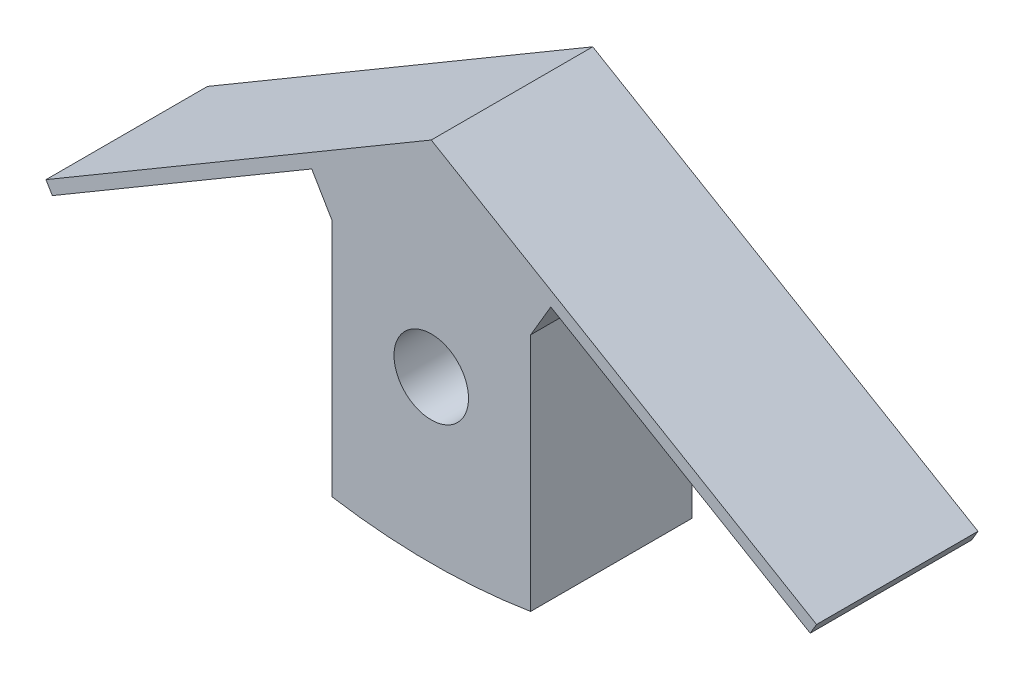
from build123d import *

# Parameters (mm, degrees)
BOSS_EXTRU_1_DEPTH           = 13
ESQUISSE2_R                  = 2
BOSS_EXTRU_2_DEPTH           = 13
ENL_V_MAT_EXTRU_2_DEPTH      = 46.068355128
ENL_V_MAT_EXTRU_2_DEPTH_BACK = 46.068355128
ESQUISSE3_R                  = 3


with BuildPart() as part:
    # Esquisse1 → Boss.-Extru.1 (new body)
    with BuildSketch(Plane.XY):
        with BuildLine():
            Line((8, -10.067284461), (8, -29.355850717))
            ThreePointArc((8, -29.355850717), (0, -30), (-8, -29.355850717))
            Line((-8, -29.355850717), (-8, -10.067284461))
            Line((-8, -10.067284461), (-9.623046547, -7.311898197))
            Line((-9.623046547, -7.311898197), (-30.511111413, -19.615908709))
            Line((-30.511111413, -19.615908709), (-31.018649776, -18.754279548))
            Line((-31.018649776, -18.754279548), (0, -0.482898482))
            Line((0, -0.482898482), (31.018649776, -18.754279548))
            Line((31.018649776, -18.754279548), (30.511111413, -19.615908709))
            Line((30.511111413, -19.615908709), (9.623046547, -7.311898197))
            Line((9.623046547, -7.311898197), (8, -10.067284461))
        make_face()
    extrude(amount=BOSS_EXTRU_1_DEPTH)

    # Esquisse2 → Boss.-Extru.2 (add)
    with BuildSketch(Plane.XY):
        with Locations((0, -26)):
            Circle(ESQUISSE2_R)
    extrude(amount=-BOSS_EXTRU_2_DEPTH)

    # Esquisse3 → Enl_v. mat.-Extru.2 (cut, two sides: drawn at the far end of the back side and taken through both)
    with BuildSketch(Plane(origin=(0, 0, 0), x_dir=(-1, 0, 0), z_dir=(0, 0, -1)).offset(-ENL_V_MAT_EXTRU_2_DEPTH_BACK)):
        with Locations((0, -17)):
            Circle(ESQUISSE3_R)
    extrude(amount=ENL_V_MAT_EXTRU_2_DEPTH + ENL_V_MAT_EXTRU_2_DEPTH_BACK, mode=Mode.SUBTRACT)


solid = part.part
